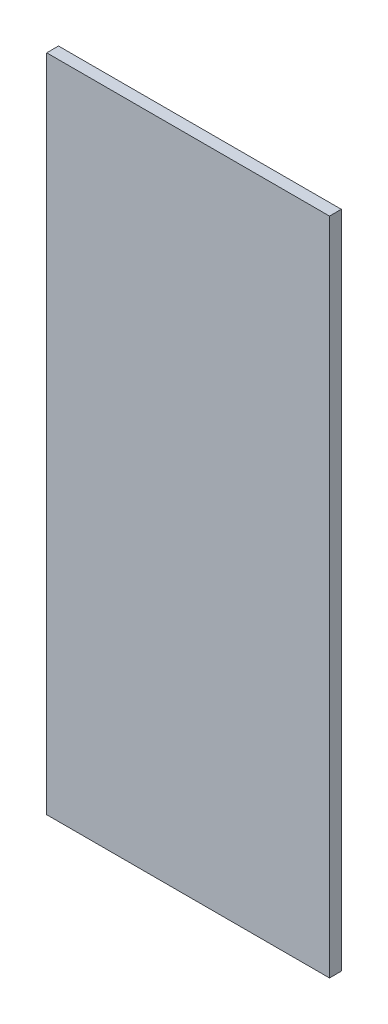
ISO-10303-21;
HEADER;
FILE_DESCRIPTION(('STEP AP214'),'2;1');
FILE_NAME('part.step','',(''),(''),'','','');
FILE_SCHEMA(('AUTOMOTIVE_DESIGN { 1 0 10303 214 1 1 1 1 }'));
ENDSEC;
DATA;
#1=APPLICATION_CONTEXT('core data for automotive mechanical design processes');
#2=APPLICATION_PROTOCOL_DEFINITION('international standard','automotive_design',2000,#1);
#3=PRODUCT_CONTEXT('',#1,'mechanical');
#4=PRODUCT('Part','Part','',(#3));
#5=PRODUCT_RELATED_PRODUCT_CATEGORY('part','',(#4));
#6=PRODUCT_DEFINITION_FORMATION('','',#4);
#7=PRODUCT_DEFINITION_CONTEXT('part definition',#1,'design');
#8=PRODUCT_DEFINITION('design','',#6,#7);
#9=PRODUCT_DEFINITION_SHAPE('','',#8);
#10=(LENGTH_UNIT() NAMED_UNIT(*) SI_UNIT(.MILLI.,.METRE.));
#11=(NAMED_UNIT(*) PLANE_ANGLE_UNIT() SI_UNIT($,.RADIAN.));
#12=(NAMED_UNIT(*) SI_UNIT($,.STERADIAN.) SOLID_ANGLE_UNIT());
#13=UNCERTAINTY_MEASURE_WITH_UNIT(LENGTH_MEASURE(1.E-05),#10,'distance_accuracy_value','');
#14=(GEOMETRIC_REPRESENTATION_CONTEXT(3) GLOBAL_UNCERTAINTY_ASSIGNED_CONTEXT((#13)) GLOBAL_UNIT_ASSIGNED_CONTEXT((#10,
#11,#12)) REPRESENTATION_CONTEXT('',''));
#15=CARTESIAN_POINT('',(0.,0.,0.));
#16=DIRECTION('',(0.,0.,1.));
#17=DIRECTION('',(1.,0.,0.));
#18=AXIS2_PLACEMENT_3D('',#15,#16,#17);
#19=CARTESIAN_POINT('',(0.,0.,19.05));
#20=DIRECTION('',(1.,0.,0.));
#21=DIRECTION('',(0.,0.,-1.));
#22=AXIS2_PLACEMENT_3D('',#19,#20,#21);
#23=PLANE('',#22);
#24=DIRECTION('',(0.,-1.,0.));
#25=VECTOR('',#24,1.);
#26=CARTESIAN_POINT('',(0.,0.,0.));
#27=LINE('',#26,#25);
#28=CARTESIAN_POINT('',(0.,1066.8,0.));
#29=VERTEX_POINT('',#28);
#30=CARTESIAN_POINT('',(0.,0.,0.));
#31=VERTEX_POINT('',#30);
#32=EDGE_CURVE('E70',#29,#31,#27,.T.);
#33=ORIENTED_EDGE('',*,*,#32,.T.);
#34=DIRECTION('',(0.,0.,-1.));
#35=VECTOR('',#34,1.);
#36=CARTESIAN_POINT('',(0.,0.,19.05));
#37=LINE('',#36,#35);
#38=CARTESIAN_POINT('',(0.,0.,19.05));
#39=VERTEX_POINT('',#38);
#40=EDGE_CURVE('E11',#39,#31,#37,.T.);
#41=ORIENTED_EDGE('',*,*,#40,.F.);
#42=DIRECTION('',(0.,-1.,0.));
#43=VECTOR('',#42,1.);
#44=CARTESIAN_POINT('',(0.,0.,19.05));
#45=LINE('',#44,#43);
#46=CARTESIAN_POINT('',(0.,1066.8,19.05));
#47=VERTEX_POINT('',#46);
#48=EDGE_CURVE('E88',#47,#39,#45,.T.);
#49=ORIENTED_EDGE('',*,*,#48,.F.);
#50=DIRECTION('',(0.,0.,-1.));
#51=VECTOR('',#50,1.);
#52=CARTESIAN_POINT('',(0.,1066.8,19.05));
#53=LINE('',#52,#51);
#54=EDGE_CURVE('E82',#47,#29,#53,.T.);
#55=ORIENTED_EDGE('',*,*,#54,.T.);
#56=EDGE_LOOP('',(#33,#41,#49,#55));
#57=FACE_BOUND('',#56,.T.);
#58=ADVANCED_FACE('F26',(#57),#23,.F.);
#59=CARTESIAN_POINT('',(0.,0.,19.05));
#60=DIRECTION('',(0.,1.,0.));
#61=DIRECTION('',(0.,0.,1.));
#62=AXIS2_PLACEMENT_3D('',#59,#60,#61);
#63=PLANE('',#62);
#64=DIRECTION('',(1.,0.,0.));
#65=VECTOR('',#64,1.);
#66=CARTESIAN_POINT('',(0.,0.,0.));
#67=LINE('',#66,#65);
#68=CARTESIAN_POINT('',(457.2,0.,0.));
#69=VERTEX_POINT('',#68);
#70=EDGE_CURVE('E66',#31,#69,#67,.T.);
#71=ORIENTED_EDGE('',*,*,#70,.T.);
#72=DIRECTION('',(0.,0.,-1.));
#73=VECTOR('',#72,1.);
#74=CARTESIAN_POINT('',(457.2,0.,19.05));
#75=LINE('',#74,#73);
#76=CARTESIAN_POINT('',(457.2,0.,19.05));
#77=VERTEX_POINT('',#76);
#78=EDGE_CURVE('E33',#77,#69,#75,.T.);
#79=ORIENTED_EDGE('',*,*,#78,.F.);
#80=DIRECTION('',(1.,0.,0.));
#81=VECTOR('',#80,1.);
#82=CARTESIAN_POINT('',(0.,0.,19.05));
#83=LINE('',#82,#81);
#84=EDGE_CURVE('E78',#39,#77,#83,.T.);
#85=ORIENTED_EDGE('',*,*,#84,.F.);
#86=ORIENTED_EDGE('',*,*,#40,.T.);
#87=EDGE_LOOP('',(#71,#79,#85,#86));
#88=FACE_BOUND('',#87,.T.);
#89=ADVANCED_FACE('F77',(#88),#63,.F.);
#90=CARTESIAN_POINT('',(457.2,0.,19.05));
#91=DIRECTION('',(-1.,0.,0.));
#92=DIRECTION('',(0.,0.,1.));
#93=AXIS2_PLACEMENT_3D('',#90,#91,#92);
#94=PLANE('',#93);
#95=DIRECTION('',(0.,1.,0.));
#96=VECTOR('',#95,1.);
#97=CARTESIAN_POINT('',(457.2,0.,0.));
#98=LINE('',#97,#96);
#99=CARTESIAN_POINT('',(457.2,1066.8,0.));
#100=VERTEX_POINT('',#99);
#101=EDGE_CURVE('E71',#69,#100,#98,.T.);
#102=ORIENTED_EDGE('',*,*,#101,.T.);
#103=DIRECTION('',(0.,0.,-1.));
#104=VECTOR('',#103,1.);
#105=CARTESIAN_POINT('',(457.2,1066.8,19.05));
#106=LINE('',#105,#104);
#107=CARTESIAN_POINT('',(457.2,1066.8,19.05));
#108=VERTEX_POINT('',#107);
#109=EDGE_CURVE('E94',#108,#100,#106,.T.);
#110=ORIENTED_EDGE('',*,*,#109,.F.);
#111=DIRECTION('',(0.,1.,0.));
#112=VECTOR('',#111,1.);
#113=CARTESIAN_POINT('',(457.2,0.,19.05));
#114=LINE('',#113,#112);
#115=EDGE_CURVE('E45',#77,#108,#114,.T.);
#116=ORIENTED_EDGE('',*,*,#115,.F.);
#117=ORIENTED_EDGE('',*,*,#78,.T.);
#118=EDGE_LOOP('',(#102,#110,#116,#117));
#119=FACE_BOUND('',#118,.T.);
#120=ADVANCED_FACE('F97',(#119),#94,.F.);
#121=CARTESIAN_POINT('',(0.,1066.8,19.05));
#122=DIRECTION('',(0.,-1.,0.));
#123=DIRECTION('',(0.,0.,-1.));
#124=AXIS2_PLACEMENT_3D('',#121,#122,#123);
#125=PLANE('',#124);
#126=DIRECTION('',(-1.,0.,0.));
#127=VECTOR('',#126,1.);
#128=CARTESIAN_POINT('',(0.,1066.8,0.));
#129=LINE('',#128,#127);
#130=EDGE_CURVE('E86',#100,#29,#129,.T.);
#131=ORIENTED_EDGE('',*,*,#130,.T.);
#132=ORIENTED_EDGE('',*,*,#54,.F.);
#133=DIRECTION('',(-1.,0.,0.));
#134=VECTOR('',#133,1.);
#135=CARTESIAN_POINT('',(0.,1066.8,19.05));
#136=LINE('',#135,#134);
#137=EDGE_CURVE('E40',#108,#47,#136,.T.);
#138=ORIENTED_EDGE('',*,*,#137,.F.);
#139=ORIENTED_EDGE('',*,*,#109,.T.);
#140=EDGE_LOOP('',(#131,#132,#138,#139));
#141=FACE_BOUND('',#140,.T.);
#142=ADVANCED_FACE('F99',(#141),#125,.F.);
#143=CARTESIAN_POINT('',(0.,1066.8,19.05));
#144=DIRECTION('',(0.,0.,-1.));
#145=DIRECTION('',(-1.,0.,0.));
#146=AXIS2_PLACEMENT_3D('',#143,#144,#145);
#147=PLANE('',#146);
#148=ORIENTED_EDGE('',*,*,#48,.T.);
#149=ORIENTED_EDGE('',*,*,#84,.T.);
#150=ORIENTED_EDGE('',*,*,#115,.T.);
#151=ORIENTED_EDGE('',*,*,#137,.T.);
#152=EDGE_LOOP('',(#148,#149,#150,#151));
#153=FACE_BOUND('',#152,.T.);
#154=ADVANCED_FACE('F100',(#153),#147,.F.);
#155=CARTESIAN_POINT('',(0.,1066.8,0.));
#156=DIRECTION('',(0.,0.,-1.));
#157=DIRECTION('',(-1.,0.,0.));
#158=AXIS2_PLACEMENT_3D('',#155,#156,#157);
#159=PLANE('',#158);
#160=ORIENTED_EDGE('',*,*,#32,.F.);
#161=ORIENTED_EDGE('',*,*,#130,.F.);
#162=ORIENTED_EDGE('',*,*,#101,.F.);
#163=ORIENTED_EDGE('',*,*,#70,.F.);
#164=EDGE_LOOP('',(#160,#161,#162,#163));
#165=FACE_BOUND('',#164,.T.);
#166=ADVANCED_FACE('F67',(#165),#159,.T.);
#167=CLOSED_SHELL('',(#58,#89,#120,#142,#154,#166));
#168=MANIFOLD_SOLID_BREP('B2',#167);
#169=ADVANCED_BREP_SHAPE_REPRESENTATION('',(#18,#168),#14);
#170=SHAPE_DEFINITION_REPRESENTATION(#9,#169);
ENDSEC;
END-ISO-10303-21;
